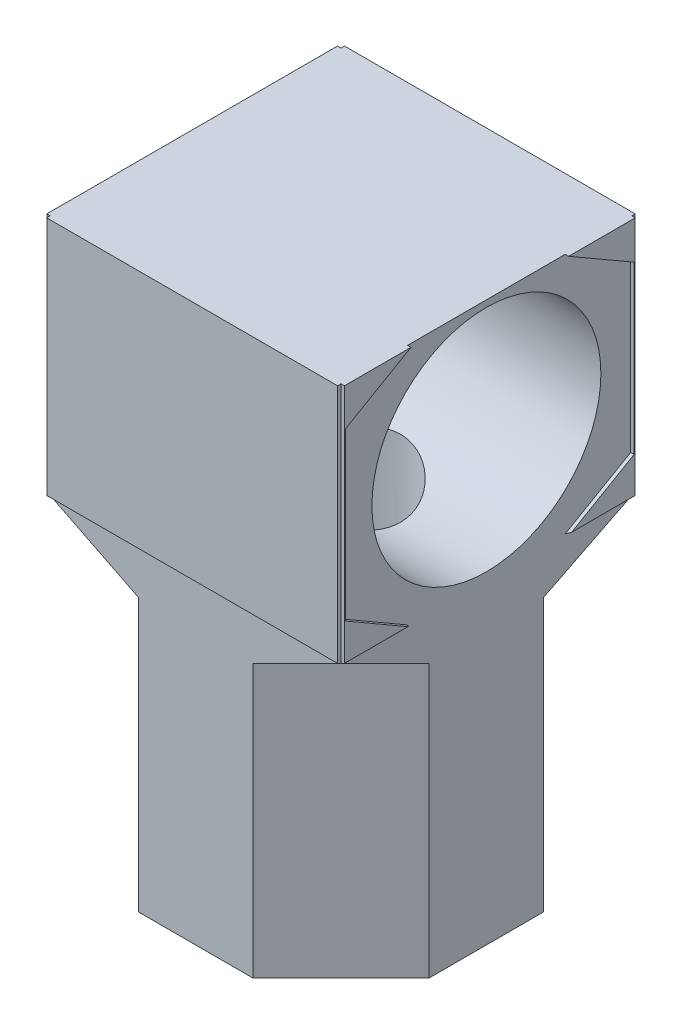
ISO-10303-21;
HEADER;
FILE_DESCRIPTION(('STEP AP214'),'2;1');
FILE_NAME('part.step','',(''),(''),'','','');
FILE_SCHEMA(('AUTOMOTIVE_DESIGN { 1 0 10303 214 1 1 1 1 }'));
ENDSEC;
DATA;
#1=APPLICATION_CONTEXT('core data for automotive mechanical design processes');
#2=APPLICATION_PROTOCOL_DEFINITION('international standard','automotive_design',2000,#1);
#3=PRODUCT_CONTEXT('',#1,'mechanical');
#4=PRODUCT('Part','Part','',(#3));
#5=PRODUCT_RELATED_PRODUCT_CATEGORY('part','',(#4));
#6=PRODUCT_DEFINITION_FORMATION('','',#4);
#7=PRODUCT_DEFINITION_CONTEXT('part definition',#1,'design');
#8=PRODUCT_DEFINITION('design','',#6,#7);
#9=PRODUCT_DEFINITION_SHAPE('','',#8);
#10=(LENGTH_UNIT() NAMED_UNIT(*) SI_UNIT(.MILLI.,.METRE.));
#11=(NAMED_UNIT(*) PLANE_ANGLE_UNIT() SI_UNIT($,.RADIAN.));
#12=(NAMED_UNIT(*) SI_UNIT($,.STERADIAN.) SOLID_ANGLE_UNIT());
#13=UNCERTAINTY_MEASURE_WITH_UNIT(LENGTH_MEASURE(1.E-05),#10,'distance_accuracy_value','');
#14=(GEOMETRIC_REPRESENTATION_CONTEXT(3) GLOBAL_UNCERTAINTY_ASSIGNED_CONTEXT((#13)) GLOBAL_UNIT_ASSIGNED_CONTEXT((#10,
#11,#12)) REPRESENTATION_CONTEXT('',''));
#15=CARTESIAN_POINT('',(0.,0.,0.));
#16=DIRECTION('',(0.,0.,1.));
#17=DIRECTION('',(1.,0.,0.));
#18=AXIS2_PLACEMENT_3D('',#15,#16,#17);
#19=CARTESIAN_POINT('',(-4.90369930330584,-0.381000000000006,-4.9036993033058));
#20=DIRECTION('',(0.,-1.,0.));
#21=DIRECTION('',(0.,0.,-1.));
#22=AXIS2_PLACEMENT_3D('',#19,#20,#21);
#23=PLANE('',#22);
#24=DIRECTION('',(1.,0.,0.));
#25=VECTOR('',#24,1.);
#26=CARTESIAN_POINT('',(-8.06450000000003,-0.381000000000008,-3.17499999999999));
#27=LINE('',#26,#25);
#28=CARTESIAN_POINT('',(-3.17500000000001,-0.381000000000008,-3.17499999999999));
#29=VERTEX_POINT('',#28);
#30=CARTESIAN_POINT('',(-8.06450000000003,-0.381000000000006,-3.17500000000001));
#31=VERTEX_POINT('',#30);
#32=EDGE_CURVE('E261',#29,#31,#27,.F.);
#33=ORIENTED_EDGE('',*,*,#32,.F.);
#34=DIRECTION('',(0.,0.,1.));
#35=VECTOR('',#34,1.);
#36=CARTESIAN_POINT('',(-3.17500000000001,-0.381000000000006,-8.06449999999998));
#37=LINE('',#36,#35);
#38=CARTESIAN_POINT('',(-3.17500000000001,-0.381000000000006,-8.06449999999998));
#39=VERTEX_POINT('',#38);
#40=EDGE_CURVE('E269',#39,#29,#37,.T.);
#41=ORIENTED_EDGE('',*,*,#40,.F.);
#42=DIRECTION('',(-0.707106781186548,0.,0.707106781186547));
#43=VECTOR('',#42,1.);
#44=CARTESIAN_POINT('',(-8.06450000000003,-0.381000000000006,-3.17500000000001));
#45=LINE('',#44,#43);
#46=EDGE_CURVE('E276',#31,#39,#45,.F.);
#47=ORIENTED_EDGE('',*,*,#46,.F.);
#48=EDGE_LOOP('',(#33,#41,#47));
#49=FACE_BOUND('',#48,.T.);
#50=ADVANCED_FACE('F17',(#49),#23,.F.);
#51=CARTESIAN_POINT('',(-3.17500000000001,-0.381000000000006,-8.06449999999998));
#52=DIRECTION('',(-0.447213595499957,-0.894427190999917,0.));
#53=DIRECTION('',(0.894427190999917,-0.447213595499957,0.));
#54=AXIS2_PLACEMENT_3D('',#51,#52,#53);
#55=PLANE('',#54);
#56=DIRECTION('',(0.,0.,-1.));
#57=VECTOR('',#56,1.);
#58=CARTESIAN_POINT('',(-3.17500000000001,-0.381000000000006,4.90369930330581));
#59=LINE('',#58,#57);
#60=CARTESIAN_POINT('',(-3.17500000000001,-0.381000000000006,3.17500000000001));
#61=VERTEX_POINT('',#60);
#62=CARTESIAN_POINT('',(-3.17500000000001,-0.381000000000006,8.06450000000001));
#63=VERTEX_POINT('',#62);
#64=EDGE_CURVE('E243',#61,#63,#59,.F.);
#65=ORIENTED_EDGE('',*,*,#64,.T.);
#66=DIRECTION('',(0.894427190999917,-0.447213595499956,0.));
#67=VECTOR('',#66,1.);
#68=CARTESIAN_POINT('',(-8.06450000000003,2.06374999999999,8.06450000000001));
#69=LINE('',#68,#67);
#70=CARTESIAN_POINT('',(-8.06450000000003,2.06374999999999,8.06450000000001));
#71=VERTEX_POINT('',#70);
#72=EDGE_CURVE('E264',#71,#63,#69,.T.);
#73=ORIENTED_EDGE('',*,*,#72,.F.);
#74=DIRECTION('',(-0.666666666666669,0.333333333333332,0.666666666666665));
#75=VECTOR('',#74,1.);
#76=CARTESIAN_POINT('',(-3.17500000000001,-0.381000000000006,3.17500000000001));
#77=LINE('',#76,#75);
#78=EDGE_CURVE('E253',#61,#71,#77,.T.);
#79=ORIENTED_EDGE('',*,*,#78,.F.);
#80=EDGE_LOOP('',(#65,#73,#79));
#81=FACE_BOUND('',#80,.T.);
#82=ADVANCED_FACE('F263',(#81),#55,.T.);
#83=CARTESIAN_POINT('',(-4.90369930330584,-0.381000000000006,4.90369930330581));
#84=DIRECTION('',(0.,-1.,0.));
#85=DIRECTION('',(0.,0.,-1.));
#86=AXIS2_PLACEMENT_3D('',#83,#84,#85);
#87=PLANE('',#86);
#88=ORIENTED_EDGE('',*,*,#64,.F.);
#89=DIRECTION('',(1.,0.,0.));
#90=VECTOR('',#89,1.);
#91=CARTESIAN_POINT('',(-8.06450000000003,-0.381000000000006,3.17500000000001));
#92=LINE('',#91,#90);
#93=CARTESIAN_POINT('',(-8.06450000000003,-0.381000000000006,3.17500000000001));
#94=VERTEX_POINT('',#93);
#95=EDGE_CURVE('E246',#94,#61,#92,.T.);
#96=ORIENTED_EDGE('',*,*,#95,.F.);
#97=DIRECTION('',(0.707106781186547,0.,0.707106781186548));
#98=VECTOR('',#97,1.);
#99=CARTESIAN_POINT('',(-3.17500000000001,-0.381000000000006,8.06450000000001));
#100=LINE('',#99,#98);
#101=EDGE_CURVE('E248',#63,#94,#100,.F.);
#102=ORIENTED_EDGE('',*,*,#101,.F.);
#103=EDGE_LOOP('',(#88,#96,#102));
#104=FACE_BOUND('',#103,.T.);
#105=ADVANCED_FACE('F245',(#104),#87,.F.);
#106=CARTESIAN_POINT('',(-8.06450000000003,-0.381000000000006,3.17500000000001));
#107=DIRECTION('',(0.,-0.894427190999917,0.447213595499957));
#108=DIRECTION('',(0.,-0.447213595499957,-0.894427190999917));
#109=AXIS2_PLACEMENT_3D('',#106,#107,#108);
#110=PLANE('',#109);
#111=DIRECTION('',(0.,-0.447213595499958,-0.894427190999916));
#112=VECTOR('',#111,1.);
#113=CARTESIAN_POINT('',(-8.06450000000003,2.06374999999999,8.06450000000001));
#114=LINE('',#113,#112);
#115=EDGE_CURVE('E260',#71,#94,#114,.T.);
#116=ORIENTED_EDGE('',*,*,#115,.T.);
#117=ORIENTED_EDGE('',*,*,#95,.T.);
#118=ORIENTED_EDGE('',*,*,#78,.T.);
#119=EDGE_LOOP('',(#116,#117,#118));
#120=FACE_BOUND('',#119,.T.);
#121=ADVANCED_FACE('F257',(#120),#110,.T.);
#122=CARTESIAN_POINT('',(-8.06450000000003,2.15899999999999,-8.25499999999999));
#123=DIRECTION('',(0.,-0.894427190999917,-0.447213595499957));
#124=DIRECTION('',(0.,0.447213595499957,-0.894427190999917));
#125=AXIS2_PLACEMENT_3D('',#122,#123,#124);
#126=PLANE('',#125);
#127=ORIENTED_EDGE('',*,*,#32,.T.);
#128=DIRECTION('',(0.,0.447213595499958,-0.894427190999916));
#129=VECTOR('',#128,1.);
#130=CARTESIAN_POINT('',(-8.06450000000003,-0.381000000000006,-3.17500000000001));
#131=LINE('',#130,#129);
#132=CARTESIAN_POINT('',(-8.06450000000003,2.06374999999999,-8.06449999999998));
#133=VERTEX_POINT('',#132);
#134=EDGE_CURVE('E286',#31,#133,#131,.T.);
#135=ORIENTED_EDGE('',*,*,#134,.T.);
#136=DIRECTION('',(-0.666666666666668,0.333333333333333,-0.666666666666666));
#137=VECTOR('',#136,1.);
#138=CARTESIAN_POINT('',(-3.17500000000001,-0.381000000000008,-3.17499999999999));
#139=LINE('',#138,#137);
#140=EDGE_CURVE('E268',#29,#133,#139,.T.);
#141=ORIENTED_EDGE('',*,*,#140,.F.);
#142=EDGE_LOOP('',(#127,#135,#141));
#143=FACE_BOUND('',#142,.T.);
#144=ADVANCED_FACE('F969',(#143),#126,.T.);
#145=CARTESIAN_POINT('',(-3.17500000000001,-0.381000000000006,-8.06449999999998));
#146=DIRECTION('',(-0.447213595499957,-0.894427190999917,0.));
#147=DIRECTION('',(0.894427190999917,-0.447213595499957,0.));
#148=AXIS2_PLACEMENT_3D('',#145,#146,#147);
#149=PLANE('',#148);
#150=DIRECTION('',(0.894427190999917,-0.447213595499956,0.));
#151=VECTOR('',#150,1.);
#152=CARTESIAN_POINT('',(-8.06450000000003,2.06374999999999,-8.06449999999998));
#153=LINE('',#152,#151);
#154=EDGE_CURVE('E289',#133,#39,#153,.T.);
#155=ORIENTED_EDGE('',*,*,#154,.T.);
#156=ORIENTED_EDGE('',*,*,#40,.T.);
#157=ORIENTED_EDGE('',*,*,#140,.T.);
#158=EDGE_LOOP('',(#155,#156,#157));
#159=FACE_BOUND('',#158,.T.);
#160=ADVANCED_FACE('F958',(#159),#149,.T.);
#161=CARTESIAN_POINT('',(-8.06450000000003,2.15899999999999,-8.25499999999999));
#162=DIRECTION('',(0.,-0.894427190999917,-0.447213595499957));
#163=DIRECTION('',(0.,0.447213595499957,-0.894427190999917));
#164=AXIS2_PLACEMENT_3D('',#161,#162,#163);
#165=PLANE('',#164);
#166=DIRECTION('',(-1.,0.,0.));
#167=VECTOR('',#166,1.);
#168=CARTESIAN_POINT('',(-8.06450000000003,2.15899999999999,-8.25499999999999));
#169=LINE('',#168,#167);
#170=CARTESIAN_POINT('',(8.06449999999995,2.15899999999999,-8.25499999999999));
#171=VERTEX_POINT('',#170);
#172=CARTESIAN_POINT('',(-8.06450000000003,2.15899999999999,-8.25499999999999));
#173=VERTEX_POINT('',#172);
#174=EDGE_CURVE('E320',#171,#173,#169,.T.);
#175=ORIENTED_EDGE('',*,*,#174,.F.);
#176=DIRECTION('',(0.,0.447213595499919,-0.894427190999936));
#177=VECTOR('',#176,1.);
#178=CARTESIAN_POINT('',(8.06449999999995,2.06374999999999,-8.06449999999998));
#179=LINE('',#178,#177);
#180=CARTESIAN_POINT('',(8.06449999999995,2.06374999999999,-8.06449999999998));
#181=VERTEX_POINT('',#180);
#182=EDGE_CURVE('E315',#181,#171,#179,.T.);
#183=ORIENTED_EDGE('',*,*,#182,.F.);
#184=DIRECTION('',(1.,0.,0.));
#185=VECTOR('',#184,1.);
#186=CARTESIAN_POINT('',(0.,2.06374999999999,-8.06449999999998));
#187=LINE('',#186,#185);
#188=EDGE_CURVE('E297',#181,#133,#187,.F.);
#189=ORIENTED_EDGE('',*,*,#188,.T.);
#190=DIRECTION('',(0.,0.447213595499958,-0.894427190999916));
#191=VECTOR('',#190,1.);
#192=CARTESIAN_POINT('',(-8.06450000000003,2.06374999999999,-8.0645));
#193=LINE('',#192,#191);
#194=EDGE_CURVE('E322',#133,#173,#193,.T.);
#195=ORIENTED_EDGE('',*,*,#194,.T.);
#196=EDGE_LOOP('',(#175,#183,#189,#195));
#197=FACE_BOUND('',#196,.T.);
#198=ADVANCED_FACE('F947',(#197),#165,.T.);
#199=CARTESIAN_POINT('',(-8.06450000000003,-0.381000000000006,3.17500000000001));
#200=DIRECTION('',(0.,-0.894427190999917,0.447213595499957));
#201=DIRECTION('',(0.,-0.447213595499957,-0.894427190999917));
#202=AXIS2_PLACEMENT_3D('',#199,#200,#201);
#203=PLANE('',#202);
#204=DIRECTION('',(1.,0.,0.));
#205=VECTOR('',#204,1.);
#206=CARTESIAN_POINT('',(-8.06450000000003,2.15899999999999,8.25499999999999));
#207=LINE('',#206,#205);
#208=CARTESIAN_POINT('',(-8.06450000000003,2.15899999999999,8.25499999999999));
#209=VERTEX_POINT('',#208);
#210=CARTESIAN_POINT('',(8.06449999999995,2.15899999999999,8.25499999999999));
#211=VERTEX_POINT('',#210);
#212=EDGE_CURVE('E334',#209,#211,#207,.T.);
#213=ORIENTED_EDGE('',*,*,#212,.F.);
#214=DIRECTION('',(0.,-0.447213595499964,-0.894427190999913));
#215=VECTOR('',#214,1.);
#216=CARTESIAN_POINT('',(-8.06450000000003,2.15899999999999,8.25499999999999));
#217=LINE('',#216,#215);
#218=EDGE_CURVE('E328',#209,#71,#217,.T.);
#219=ORIENTED_EDGE('',*,*,#218,.T.);
#220=DIRECTION('',(1.,0.,0.));
#221=VECTOR('',#220,1.);
#222=CARTESIAN_POINT('',(0.,2.06374999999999,8.06450000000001));
#223=LINE('',#222,#221);
#224=CARTESIAN_POINT('',(8.06449999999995,2.06374999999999,8.06450000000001));
#225=VERTEX_POINT('',#224);
#226=EDGE_CURVE('E278',#225,#71,#223,.F.);
#227=ORIENTED_EDGE('',*,*,#226,.F.);
#228=DIRECTION('',(0.,-0.447213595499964,-0.894427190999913));
#229=VECTOR('',#228,1.);
#230=CARTESIAN_POINT('',(8.06449999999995,2.15899999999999,8.25499999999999));
#231=LINE('',#230,#229);
#232=EDGE_CURVE('E339',#211,#225,#231,.T.);
#233=ORIENTED_EDGE('',*,*,#232,.F.);
#234=EDGE_LOOP('',(#213,#219,#227,#233));
#235=FACE_BOUND('',#234,.T.);
#236=ADVANCED_FACE('F936',(#235),#203,.T.);
#237=CARTESIAN_POINT('',(8.25499999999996,2.15899999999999,-8.06449999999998));
#238=DIRECTION('',(0.447213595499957,-0.894427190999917,0.));
#239=DIRECTION('',(0.894427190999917,0.447213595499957,0.));
#240=AXIS2_PLACEMENT_3D('',#237,#238,#239);
#241=PLANE('',#240);
#242=DIRECTION('',(0.894427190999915,0.44721359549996,0.));
#243=VECTOR('',#242,1.);
#244=CARTESIAN_POINT('',(3.17499999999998,-0.381000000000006,8.06450000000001));
#245=LINE('',#244,#243);
#246=CARTESIAN_POINT('',(3.17499999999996,-0.381000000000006,8.06449999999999));
#247=VERTEX_POINT('',#246);
#248=EDGE_CURVE('E279',#247,#225,#245,.T.);
#249=ORIENTED_EDGE('',*,*,#248,.F.);
#250=DIRECTION('',(0.,0.,-1.));
#251=VECTOR('',#250,1.);
#252=CARTESIAN_POINT('',(3.17499999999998,-0.381000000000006,4.90369930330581));
#253=LINE('',#252,#251);
#254=CARTESIAN_POINT('',(3.17499999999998,-0.381000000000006,3.17500000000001));
#255=VERTEX_POINT('',#254);
#256=EDGE_CURVE('E272',#247,#255,#253,.T.);
#257=ORIENTED_EDGE('',*,*,#256,.T.);
#258=DIRECTION('',(-0.666666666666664,-0.333333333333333,-0.666666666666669));
#259=VECTOR('',#258,1.);
#260=CARTESIAN_POINT('',(8.06449999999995,2.06374999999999,8.06450000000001));
#261=LINE('',#260,#259);
#262=EDGE_CURVE('E364',#225,#255,#261,.T.);
#263=ORIENTED_EDGE('',*,*,#262,.F.);
#264=EDGE_LOOP('',(#249,#257,#263));
#265=FACE_BOUND('',#264,.T.);
#266=ADVANCED_FACE('F925',(#265),#241,.T.);
#267=CARTESIAN_POINT('',(4.90369930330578,-0.381000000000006,4.90369930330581));
#268=DIRECTION('',(0.,-1.,0.));
#269=DIRECTION('',(0.,0.,-1.));
#270=AXIS2_PLACEMENT_3D('',#267,#268,#269);
#271=PLANE('',#270);
#272=DIRECTION('',(1.,0.,0.));
#273=VECTOR('',#272,1.);
#274=CARTESIAN_POINT('',(-8.06450000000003,-0.381000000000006,3.17500000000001));
#275=LINE('',#274,#273);
#276=CARTESIAN_POINT('',(8.06449999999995,-0.381000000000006,3.17500000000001));
#277=VERTEX_POINT('',#276);
#278=EDGE_CURVE('E73',#255,#277,#275,.T.);
#279=ORIENTED_EDGE('',*,*,#278,.F.);
#280=ORIENTED_EDGE('',*,*,#256,.F.);
#281=DIRECTION('',(0.707106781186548,0.,-0.707106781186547));
#282=VECTOR('',#281,1.);
#283=CARTESIAN_POINT('',(8.06449999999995,-0.381000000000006,3.17500000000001));
#284=LINE('',#283,#282);
#285=EDGE_CURVE('E368',#277,#247,#284,.F.);
#286=ORIENTED_EDGE('',*,*,#285,.F.);
#287=EDGE_LOOP('',(#279,#280,#286));
#288=FACE_BOUND('',#287,.T.);
#289=ADVANCED_FACE('F914',(#288),#271,.F.);
#290=CARTESIAN_POINT('',(-8.06450000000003,-15.494,-3.17500000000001));
#291=DIRECTION('',(-0.707106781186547,0.,-0.707106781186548));
#292=DIRECTION('',(-0.707106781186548,0.,0.707106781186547));
#293=AXIS2_PLACEMENT_3D('',#290,#291,#292);
#294=PLANE('',#293);
#295=DIRECTION('',(0.70710678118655,0.,-0.707106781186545));
#296=VECTOR('',#295,1.);
#297=CARTESIAN_POINT('',(-8.06450000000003,-15.494,-3.17500000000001));
#298=LINE('',#297,#296);
#299=CARTESIAN_POINT('',(-8.06450000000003,-15.494,-3.17500000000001));
#300=VERTEX_POINT('',#299);
#301=CARTESIAN_POINT('',(-3.17500000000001,-15.494,-8.06450000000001));
#302=VERTEX_POINT('',#301);
#303=EDGE_CURVE('E372',#300,#302,#298,.T.);
#304=ORIENTED_EDGE('',*,*,#303,.F.);
#305=DIRECTION('',(0.,1.,0.));
#306=VECTOR('',#305,1.);
#307=CARTESIAN_POINT('',(-8.06450000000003,1.78895756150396,-3.17500000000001));
#308=LINE('',#307,#306);
#309=EDGE_CURVE('E290',#300,#31,#308,.T.);
#310=ORIENTED_EDGE('',*,*,#309,.T.);
#311=ORIENTED_EDGE('',*,*,#46,.T.);
#312=DIRECTION('',(0.,1.,0.));
#313=VECTOR('',#312,1.);
#314=CARTESIAN_POINT('',(-3.17500000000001,1.78895756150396,-8.06449999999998));
#315=LINE('',#314,#313);
#316=EDGE_CURVE('E301',#39,#302,#315,.F.);
#317=ORIENTED_EDGE('',*,*,#316,.T.);
#318=EDGE_LOOP('',(#304,#310,#311,#317));
#319=FACE_BOUND('',#318,.T.);
#320=ADVANCED_FACE('F903',(#319),#294,.T.);
#321=CARTESIAN_POINT('',(0.,1.78895756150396,8.06450000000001));
#322=DIRECTION('',(0.,0.,1.));
#323=DIRECTION('',(1.,0.,0.));
#324=AXIS2_PLACEMENT_3D('',#321,#322,#323);
#325=PLANE('',#324);
#326=DIRECTION('',(0.,1.,0.));
#327=VECTOR('',#326,1.);
#328=CARTESIAN_POINT('',(3.17499999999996,-15.494,8.06449999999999));
#329=LINE('',#328,#327);
#330=CARTESIAN_POINT('',(3.17499999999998,-15.494,8.06450000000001));
#331=VERTEX_POINT('',#330);
#332=EDGE_CURVE('E370',#247,#331,#329,.F.);
#333=ORIENTED_EDGE('',*,*,#332,.F.);
#334=ORIENTED_EDGE('',*,*,#248,.T.);
#335=ORIENTED_EDGE('',*,*,#226,.T.);
#336=ORIENTED_EDGE('',*,*,#72,.T.);
#337=DIRECTION('',(0.,1.,0.));
#338=VECTOR('',#337,1.);
#339=CARTESIAN_POINT('',(-3.17500000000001,-15.494,8.06450000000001));
#340=LINE('',#339,#338);
#341=CARTESIAN_POINT('',(-3.17500000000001,-15.494,8.06450000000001));
#342=VERTEX_POINT('',#341);
#343=EDGE_CURVE('E283',#342,#63,#340,.T.);
#344=ORIENTED_EDGE('',*,*,#343,.F.);
#345=DIRECTION('',(1.,0.,0.));
#346=VECTOR('',#345,1.);
#347=CARTESIAN_POINT('',(4.90369930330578,-15.494,8.06450000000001));
#348=LINE('',#347,#346);
#349=EDGE_CURVE('E381',#331,#342,#348,.F.);
#350=ORIENTED_EDGE('',*,*,#349,.F.);
#351=EDGE_LOOP('',(#333,#334,#335,#336,#344,#350));
#352=FACE_BOUND('',#351,.T.);
#353=ADVANCED_FACE('F892',(#352),#325,.T.);
#354=CARTESIAN_POINT('',(-3.17500000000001,-15.494,8.06450000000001));
#355=DIRECTION('',(-0.707106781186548,0.,0.707106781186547));
#356=DIRECTION('',(0.707106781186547,0.,0.707106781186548));
#357=AXIS2_PLACEMENT_3D('',#354,#355,#356);
#358=PLANE('',#357);
#359=DIRECTION('',(-0.70710678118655,0.,-0.707106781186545));
#360=VECTOR('',#359,1.);
#361=CARTESIAN_POINT('',(-3.17500000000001,-15.494,8.06450000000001));
#362=LINE('',#361,#360);
#363=CARTESIAN_POINT('',(-8.06450000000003,-15.494,3.17500000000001));
#364=VERTEX_POINT('',#363);
#365=EDGE_CURVE('E379',#342,#364,#362,.T.);
#366=ORIENTED_EDGE('',*,*,#365,.F.);
#367=ORIENTED_EDGE('',*,*,#343,.T.);
#368=ORIENTED_EDGE('',*,*,#101,.T.);
#369=DIRECTION('',(0.,1.,0.));
#370=VECTOR('',#369,1.);
#371=CARTESIAN_POINT('',(-8.06450000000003,1.78895756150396,3.17500000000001));
#372=LINE('',#371,#370);
#373=EDGE_CURVE('E293',#94,#364,#372,.F.);
#374=ORIENTED_EDGE('',*,*,#373,.T.);
#375=EDGE_LOOP('',(#366,#367,#368,#374));
#376=FACE_BOUND('',#375,.T.);
#377=ADVANCED_FACE('F881',(#376),#358,.T.);
#378=CARTESIAN_POINT('',(-8.06450000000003,1.78895756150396,0.));
#379=DIRECTION('',(1.,0.,0.));
#380=DIRECTION('',(0.,0.,-1.));
#381=AXIS2_PLACEMENT_3D('',#378,#379,#380);
#382=PLANE('',#381);
#383=ORIENTED_EDGE('',*,*,#134,.F.);
#384=ORIENTED_EDGE('',*,*,#309,.F.);
#385=DIRECTION('',(0.,0.,-1.));
#386=VECTOR('',#385,1.);
#387=CARTESIAN_POINT('',(-8.06450000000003,-15.494,-4.9036993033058));
#388=LINE('',#387,#386);
#389=EDGE_CURVE('E375',#364,#300,#388,.T.);
#390=ORIENTED_EDGE('',*,*,#389,.F.);
#391=ORIENTED_EDGE('',*,*,#373,.F.);
#392=ORIENTED_EDGE('',*,*,#115,.F.);
#393=DIRECTION('',(0.,0.,1.));
#394=VECTOR('',#393,1.);
#395=CARTESIAN_POINT('',(-8.06450000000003,2.06375,-8.06449999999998));
#396=LINE('',#395,#394);
#397=EDGE_CURVE('E354',#133,#71,#396,.T.);
#398=ORIENTED_EDGE('',*,*,#397,.F.);
#399=EDGE_LOOP('',(#383,#384,#390,#391,#392,#398));
#400=FACE_BOUND('',#399,.T.);
#401=ADVANCED_FACE('F870',(#400),#382,.F.);
#402=CARTESIAN_POINT('',(0.,1.78895756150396,-8.06449999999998));
#403=DIRECTION('',(0.,0.,1.));
#404=DIRECTION('',(1.,0.,0.));
#405=AXIS2_PLACEMENT_3D('',#402,#403,#404);
#406=PLANE('',#405);
#407=DIRECTION('',(0.894427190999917,0.447213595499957,0.));
#408=VECTOR('',#407,1.);
#409=CARTESIAN_POINT('',(8.25499999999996,2.15899999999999,-8.0645));
#410=LINE('',#409,#408);
#411=CARTESIAN_POINT('',(3.17499999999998,-0.381000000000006,-8.0645));
#412=VERTEX_POINT('',#411);
#413=EDGE_CURVE('E300',#412,#181,#410,.T.);
#414=ORIENTED_EDGE('',*,*,#413,.F.);
#415=DIRECTION('',(0.,1.,0.));
#416=VECTOR('',#415,1.);
#417=CARTESIAN_POINT('',(3.17499999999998,-15.494,-8.0645));
#418=LINE('',#417,#416);
#419=CARTESIAN_POINT('',(3.17499999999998,-15.494,-8.0645));
#420=VERTEX_POINT('',#419);
#421=EDGE_CURVE('E389',#420,#412,#418,.T.);
#422=ORIENTED_EDGE('',*,*,#421,.F.);
#423=DIRECTION('',(1.,0.,0.));
#424=VECTOR('',#423,1.);
#425=CARTESIAN_POINT('',(4.90369930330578,-15.494,-8.0645));
#426=LINE('',#425,#424);
#427=EDGE_CURVE('E386',#302,#420,#426,.T.);
#428=ORIENTED_EDGE('',*,*,#427,.F.);
#429=ORIENTED_EDGE('',*,*,#316,.F.);
#430=ORIENTED_EDGE('',*,*,#154,.F.);
#431=ORIENTED_EDGE('',*,*,#188,.F.);
#432=EDGE_LOOP('',(#414,#422,#428,#429,#430,#431));
#433=FACE_BOUND('',#432,.T.);
#434=ADVANCED_FACE('F859',(#433),#406,.F.);
#435=CARTESIAN_POINT('',(8.25499999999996,2.15899999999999,-8.06449999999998));
#436=DIRECTION('',(0.447213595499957,-0.894427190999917,0.));
#437=DIRECTION('',(0.894427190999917,0.447213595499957,0.));
#438=AXIS2_PLACEMENT_3D('',#435,#436,#437);
#439=PLANE('',#438);
#440=DIRECTION('',(0.,0.,-1.));
#441=VECTOR('',#440,1.);
#442=CARTESIAN_POINT('',(3.17499999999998,-0.381000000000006,-4.9036993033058));
#443=LINE('',#442,#441);
#444=CARTESIAN_POINT('',(3.17499999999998,-0.381000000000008,-3.17499999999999));
#445=VERTEX_POINT('',#444);
#446=EDGE_CURVE('E308',#445,#412,#443,.T.);
#447=ORIENTED_EDGE('',*,*,#446,.T.);
#448=ORIENTED_EDGE('',*,*,#413,.T.);
#449=DIRECTION('',(0.666666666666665,0.333333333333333,-0.666666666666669));
#450=VECTOR('',#449,1.);
#451=CARTESIAN_POINT('',(3.17499999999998,-0.381000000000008,-3.17499999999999));
#452=LINE('',#451,#450);
#453=EDGE_CURVE('E392',#445,#181,#452,.T.);
#454=ORIENTED_EDGE('',*,*,#453,.F.);
#455=EDGE_LOOP('',(#447,#448,#454));
#456=FACE_BOUND('',#455,.T.);
#457=ADVANCED_FACE('F848',(#456),#439,.T.);
#458=CARTESIAN_POINT('',(4.90369930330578,-0.381000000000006,-4.9036993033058));
#459=DIRECTION('',(0.,-1.,0.));
#460=DIRECTION('',(0.,0.,-1.));
#461=AXIS2_PLACEMENT_3D('',#458,#459,#460);
#462=PLANE('',#461);
#463=ORIENTED_EDGE('',*,*,#446,.F.);
#464=DIRECTION('',(1.,0.,0.));
#465=VECTOR('',#464,1.);
#466=CARTESIAN_POINT('',(-8.06450000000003,-0.381000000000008,-3.17499999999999));
#467=LINE('',#466,#465);
#468=CARTESIAN_POINT('',(8.06449999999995,-0.381000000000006,-3.17499999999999));
#469=VERTEX_POINT('',#468);
#470=EDGE_CURVE('E397',#469,#445,#467,.F.);
#471=ORIENTED_EDGE('',*,*,#470,.F.);
#472=DIRECTION('',(-0.707106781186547,0.,-0.707106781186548));
#473=VECTOR('',#472,1.);
#474=CARTESIAN_POINT('',(3.17499999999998,-0.381000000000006,-8.0645));
#475=LINE('',#474,#473);
#476=EDGE_CURVE('E378',#412,#469,#475,.F.);
#477=ORIENTED_EDGE('',*,*,#476,.F.);
#478=EDGE_LOOP('',(#463,#471,#477));
#479=FACE_BOUND('',#478,.T.);
#480=ADVANCED_FACE('F837',(#479),#462,.F.);
#481=CARTESIAN_POINT('',(8.25499999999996,14.351,-8.06449999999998));
#482=DIRECTION('',(1.,0.,0.));
#483=DIRECTION('',(0.,0.,-1.));
#484=AXIS2_PLACEMENT_3D('',#481,#482,#483);
#485=PLANE('',#484);
#486=DIRECTION('',(0.,0.499999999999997,0.86602540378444));
#487=VECTOR('',#486,1.);
#488=CARTESIAN_POINT('',(8.25499999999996,13.3982545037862,-8.00099999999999));
#489=LINE('',#488,#487);
#490=CARTESIAN_POINT('',(8.25499999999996,15.494,-4.37106232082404));
#491=VERTEX_POINT('',#490);
#492=CARTESIAN_POINT('',(8.25499999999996,13.3982545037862,-8.00099999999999));
#493=VERTEX_POINT('',#492);
#494=EDGE_CURVE('E420',#491,#493,#489,.F.);
#495=ORIENTED_EDGE('',*,*,#494,.T.);
#496=DIRECTION('',(0.,1.,0.));
#497=VECTOR('',#496,1.);
#498=CARTESIAN_POINT('',(8.25499999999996,4.15949549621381,-8.00099999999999));
#499=LINE('',#498,#497);
#500=CARTESIAN_POINT('',(8.25499999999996,4.15949549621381,-8.00099999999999));
#501=VERTEX_POINT('',#500);
#502=EDGE_CURVE('E414',#493,#501,#499,.F.);
#503=ORIENTED_EDGE('',*,*,#502,.T.);
#504=DIRECTION('',(0.,0.499999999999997,-0.86602540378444));
#505=VECTOR('',#504,1.);
#506=CARTESIAN_POINT('',(8.25499999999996,-0.459884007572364,0.));
#507=LINE('',#506,#505);
#508=CARTESIAN_POINT('',(8.25499999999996,2.15899999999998,-4.53604016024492));
#509=VERTEX_POINT('',#508);
#510=EDGE_CURVE('E405',#501,#509,#507,.F.);
#511=ORIENTED_EDGE('',*,*,#510,.T.);
#512=DIRECTION('',(0.,0.,1.));
#513=VECTOR('',#512,1.);
#514=CARTESIAN_POINT('',(8.25499999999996,2.15899999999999,-8.06449999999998));
#515=LINE('',#514,#513);
#516=CARTESIAN_POINT('',(8.25499999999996,2.15899999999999,-8.06449999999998));
#517=VERTEX_POINT('',#516);
#518=EDGE_CURVE('E403',#517,#509,#515,.T.);
#519=ORIENTED_EDGE('',*,*,#518,.F.);
#520=DIRECTION('',(0.,1.,0.));
#521=VECTOR('',#520,1.);
#522=CARTESIAN_POINT('',(8.25499999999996,1.78895756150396,-8.06449999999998));
#523=LINE('',#522,#521);
#524=CARTESIAN_POINT('',(8.25499999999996,15.494,-8.06449999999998));
#525=VERTEX_POINT('',#524);
#526=EDGE_CURVE('E311',#517,#525,#523,.T.);
#527=ORIENTED_EDGE('',*,*,#526,.T.);
#528=DIRECTION('',(0.,0.,1.));
#529=VECTOR('',#528,1.);
#530=CARTESIAN_POINT('',(8.25499999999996,15.494,-8.06449999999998));
#531=LINE('',#530,#529);
#532=EDGE_CURVE('E450',#491,#525,#531,.F.);
#533=ORIENTED_EDGE('',*,*,#532,.F.);
#534=EDGE_LOOP('',(#495,#503,#511,#519,#527,#533));
#535=FACE_BOUND('',#534,.T.);
#536=ADVANCED_FACE('F826',(#535),#485,.T.);
#537=CARTESIAN_POINT('',(0.,1.78895756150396,-8.06449999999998));
#538=DIRECTION('',(0.,0.,1.));
#539=DIRECTION('',(1.,0.,0.));
#540=AXIS2_PLACEMENT_3D('',#537,#538,#539);
#541=PLANE('',#540);
#542=DIRECTION('',(1.,0.,0.));
#543=VECTOR('',#542,1.);
#544=CARTESIAN_POINT('',(-8.25499999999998,15.494,-8.06449999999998));
#545=LINE('',#544,#543);
#546=CARTESIAN_POINT('',(8.06449999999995,15.494,-8.06449999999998));
#547=VERTEX_POINT('',#546);
#548=EDGE_CURVE('E448',#525,#547,#545,.F.);
#549=ORIENTED_EDGE('',*,*,#548,.F.);
#550=ORIENTED_EDGE('',*,*,#526,.F.);
#551=DIRECTION('',(0.894427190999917,0.447213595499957,0.));
#552=VECTOR('',#551,1.);
#553=CARTESIAN_POINT('',(8.25499999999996,2.15899999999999,-8.06449999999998));
#554=LINE('',#553,#552);
#555=EDGE_CURVE('E400',#181,#517,#554,.T.);
#556=ORIENTED_EDGE('',*,*,#555,.F.);
#557=DIRECTION('',(0.,1.,0.));
#558=VECTOR('',#557,1.);
#559=CARTESIAN_POINT('',(8.06449999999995,1.78895756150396,-8.06449999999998));
#560=LINE('',#559,#558);
#561=EDGE_CURVE('E314',#547,#181,#560,.F.);
#562=ORIENTED_EDGE('',*,*,#561,.F.);
#563=EDGE_LOOP('',(#549,#550,#556,#562));
#564=FACE_BOUND('',#563,.T.);
#565=ADVANCED_FACE('F815',(#564),#541,.F.);
#566=CARTESIAN_POINT('',(8.06449999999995,1.78895756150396,0.));
#567=DIRECTION('',(1.,0.,0.));
#568=DIRECTION('',(0.,0.,-1.));
#569=AXIS2_PLACEMENT_3D('',#566,#567,#568);
#570=PLANE('',#569);
#571=DIRECTION('',(0.,1.,0.));
#572=VECTOR('',#571,1.);
#573=CARTESIAN_POINT('',(8.06449999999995,14.351,-8.25499999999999));
#574=LINE('',#573,#572);
#575=CARTESIAN_POINT('',(8.06449999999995,15.494,-8.25499999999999));
#576=VERTEX_POINT('',#575);
#577=EDGE_CURVE('E317',#576,#171,#574,.F.);
#578=ORIENTED_EDGE('',*,*,#577,.F.);
#579=DIRECTION('',(0.,0.,1.));
#580=VECTOR('',#579,1.);
#581=CARTESIAN_POINT('',(8.06449999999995,15.494,-8.06449999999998));
#582=LINE('',#581,#580);
#583=EDGE_CURVE('E446',#547,#576,#582,.F.);
#584=ORIENTED_EDGE('',*,*,#583,.F.);
#585=ORIENTED_EDGE('',*,*,#561,.T.);
#586=ORIENTED_EDGE('',*,*,#182,.T.);
#587=EDGE_LOOP('',(#578,#584,#585,#586));
#588=FACE_BOUND('',#587,.T.);
#589=ADVANCED_FACE('F804',(#588),#570,.T.);
#590=CARTESIAN_POINT('',(-8.06450000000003,14.351,-8.25499999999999));
#591=DIRECTION('',(0.,0.,-1.));
#592=DIRECTION('',(-1.,0.,0.));
#593=AXIS2_PLACEMENT_3D('',#590,#591,#592);
#594=PLANE('',#593);
#595=DIRECTION('',(0.,1.,0.));
#596=VECTOR('',#595,1.);
#597=CARTESIAN_POINT('',(-8.06450000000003,1.78895756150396,-8.25499999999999));
#598=LINE('',#597,#596);
#599=CARTESIAN_POINT('',(-8.06450000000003,15.494,-8.25499999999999));
#600=VERTEX_POINT('',#599);
#601=EDGE_CURVE('E325',#173,#600,#598,.T.);
#602=ORIENTED_EDGE('',*,*,#601,.T.);
#603=DIRECTION('',(1.,0.,0.));
#604=VECTOR('',#603,1.);
#605=CARTESIAN_POINT('',(-8.25499999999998,15.494,-8.25499999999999));
#606=LINE('',#605,#604);
#607=EDGE_CURVE('E444',#576,#600,#606,.F.);
#608=ORIENTED_EDGE('',*,*,#607,.F.);
#609=ORIENTED_EDGE('',*,*,#577,.T.);
#610=ORIENTED_EDGE('',*,*,#174,.T.);
#611=EDGE_LOOP('',(#602,#608,#609,#610));
#612=FACE_BOUND('',#611,.T.);
#613=ADVANCED_FACE('F793',(#612),#594,.T.);
#614=CARTESIAN_POINT('',(-8.06450000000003,1.78895756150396,0.));
#615=DIRECTION('',(1.,0.,0.));
#616=DIRECTION('',(0.,0.,-1.));
#617=AXIS2_PLACEMENT_3D('',#614,#615,#616);
#618=PLANE('',#617);
#619=DIRECTION('',(0.,0.,1.));
#620=VECTOR('',#619,1.);
#621=CARTESIAN_POINT('',(-8.06450000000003,15.494,-8.06449999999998));
#622=LINE('',#621,#620);
#623=CARTESIAN_POINT('',(-8.06450000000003,15.494,-8.0645));
#624=VERTEX_POINT('',#623);
#625=EDGE_CURVE('E442',#600,#624,#622,.T.);
#626=ORIENTED_EDGE('',*,*,#625,.F.);
#627=ORIENTED_EDGE('',*,*,#601,.F.);
#628=ORIENTED_EDGE('',*,*,#194,.F.);
#629=DIRECTION('',(0.,1.,0.));
#630=VECTOR('',#629,1.);
#631=CARTESIAN_POINT('',(-8.06450000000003,1.78895756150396,-8.06449999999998));
#632=LINE('',#631,#630);
#633=EDGE_CURVE('E351',#133,#624,#632,.T.);
#634=ORIENTED_EDGE('',*,*,#633,.T.);
#635=EDGE_LOOP('',(#626,#627,#628,#634));
#636=FACE_BOUND('',#635,.T.);
#637=ADVANCED_FACE('F782',(#636),#618,.F.);
#638=CARTESIAN_POINT('',(-8.06450000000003,1.78895756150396,0.));
#639=DIRECTION('',(1.,0.,0.));
#640=DIRECTION('',(0.,0.,-1.));
#641=AXIS2_PLACEMENT_3D('',#638,#639,#640);
#642=PLANE('',#641);
#643=ORIENTED_EDGE('',*,*,#218,.F.);
#644=DIRECTION('',(0.,1.,0.));
#645=VECTOR('',#644,1.);
#646=CARTESIAN_POINT('',(-8.06450000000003,14.351,8.25499999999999));
#647=LINE('',#646,#645);
#648=CARTESIAN_POINT('',(-8.06450000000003,15.494,8.25499999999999));
#649=VERTEX_POINT('',#648);
#650=EDGE_CURVE('E333',#649,#209,#647,.F.);
#651=ORIENTED_EDGE('',*,*,#650,.F.);
#652=DIRECTION('',(0.,0.,1.));
#653=VECTOR('',#652,1.);
#654=CARTESIAN_POINT('',(-8.06450000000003,15.494,-8.06449999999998));
#655=LINE('',#654,#653);
#656=CARTESIAN_POINT('',(-8.06450000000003,15.494,8.06450000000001));
#657=VERTEX_POINT('',#656);
#658=EDGE_CURVE('E435',#657,#649,#655,.T.);
#659=ORIENTED_EDGE('',*,*,#658,.F.);
#660=DIRECTION('',(0.,1.,0.));
#661=VECTOR('',#660,1.);
#662=CARTESIAN_POINT('',(-8.06450000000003,1.78895756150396,8.06450000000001));
#663=LINE('',#662,#661);
#664=EDGE_CURVE('E349',#71,#657,#663,.T.);
#665=ORIENTED_EDGE('',*,*,#664,.F.);
#666=EDGE_LOOP('',(#643,#651,#659,#665));
#667=FACE_BOUND('',#666,.T.);
#668=ADVANCED_FACE('F771',(#667),#642,.F.);
#669=CARTESIAN_POINT('',(-8.06450000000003,14.351,8.25499999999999));
#670=DIRECTION('',(0.,0.,1.));
#671=DIRECTION('',(1.,0.,0.));
#672=AXIS2_PLACEMENT_3D('',#669,#670,#671);
#673=PLANE('',#672);
#674=ORIENTED_EDGE('',*,*,#650,.T.);
#675=ORIENTED_EDGE('',*,*,#212,.T.);
#676=DIRECTION('',(0.,1.,0.));
#677=VECTOR('',#676,1.);
#678=CARTESIAN_POINT('',(8.06449999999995,1.78895756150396,8.25499999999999));
#679=LINE('',#678,#677);
#680=CARTESIAN_POINT('',(8.06449999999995,15.494,8.25499999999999));
#681=VERTEX_POINT('',#680);
#682=EDGE_CURVE('E336',#681,#211,#679,.F.);
#683=ORIENTED_EDGE('',*,*,#682,.F.);
#684=DIRECTION('',(1.,0.,0.));
#685=VECTOR('',#684,1.);
#686=CARTESIAN_POINT('',(-8.25499999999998,15.494,8.25499999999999));
#687=LINE('',#686,#685);
#688=EDGE_CURVE('E433',#649,#681,#687,.T.);
#689=ORIENTED_EDGE('',*,*,#688,.F.);
#690=EDGE_LOOP('',(#674,#675,#683,#689));
#691=FACE_BOUND('',#690,.T.);
#692=ADVANCED_FACE('F760',(#691),#673,.T.);
#693=CARTESIAN_POINT('',(8.06449999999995,1.78895756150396,0.));
#694=DIRECTION('',(1.,0.,0.));
#695=DIRECTION('',(0.,0.,-1.));
#696=AXIS2_PLACEMENT_3D('',#693,#694,#695);
#697=PLANE('',#696);
#698=ORIENTED_EDGE('',*,*,#682,.T.);
#699=ORIENTED_EDGE('',*,*,#232,.T.);
#700=DIRECTION('',(0.,1.,0.));
#701=VECTOR('',#700,1.);
#702=CARTESIAN_POINT('',(8.06449999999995,1.78895756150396,8.06450000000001));
#703=LINE('',#702,#701);
#704=CARTESIAN_POINT('',(8.06449999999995,15.494,8.06450000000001));
#705=VERTEX_POINT('',#704);
#706=EDGE_CURVE('E342',#705,#225,#703,.F.);
#707=ORIENTED_EDGE('',*,*,#706,.F.);
#708=DIRECTION('',(0.,0.,1.));
#709=VECTOR('',#708,1.);
#710=CARTESIAN_POINT('',(8.06449999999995,15.494,-8.06449999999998));
#711=LINE('',#710,#709);
#712=EDGE_CURVE('E431',#681,#705,#711,.F.);
#713=ORIENTED_EDGE('',*,*,#712,.F.);
#714=EDGE_LOOP('',(#698,#699,#707,#713));
#715=FACE_BOUND('',#714,.T.);
#716=ADVANCED_FACE('F749',(#715),#697,.T.);
#717=CARTESIAN_POINT('',(0.,1.78895756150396,8.06450000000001));
#718=DIRECTION('',(0.,0.,1.));
#719=DIRECTION('',(1.,0.,0.));
#720=AXIS2_PLACEMENT_3D('',#717,#718,#719);
#721=PLANE('',#720);
#722=DIRECTION('',(0.,1.,0.));
#723=VECTOR('',#722,1.);
#724=CARTESIAN_POINT('',(8.25499999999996,14.351,8.06450000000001));
#725=LINE('',#724,#723);
#726=CARTESIAN_POINT('',(8.25499999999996,15.494,8.06450000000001));
#727=VERTEX_POINT('',#726);
#728=CARTESIAN_POINT('',(8.25499999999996,2.15899999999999,8.06450000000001));
#729=VERTEX_POINT('',#728);
#730=EDGE_CURVE('E347',#727,#729,#725,.F.);
#731=ORIENTED_EDGE('',*,*,#730,.F.);
#732=DIRECTION('',(1.,0.,0.));
#733=VECTOR('',#732,1.);
#734=CARTESIAN_POINT('',(-8.25499999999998,15.494,8.06450000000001));
#735=LINE('',#734,#733);
#736=EDGE_CURVE('E429',#705,#727,#735,.T.);
#737=ORIENTED_EDGE('',*,*,#736,.F.);
#738=ORIENTED_EDGE('',*,*,#706,.T.);
#739=DIRECTION('',(0.894427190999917,0.447213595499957,0.));
#740=VECTOR('',#739,1.);
#741=CARTESIAN_POINT('',(8.25499999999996,2.15899999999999,8.06450000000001));
#742=LINE('',#741,#740);
#743=EDGE_CURVE('E361',#729,#225,#742,.F.);
#744=ORIENTED_EDGE('',*,*,#743,.F.);
#745=EDGE_LOOP('',(#731,#737,#738,#744));
#746=FACE_BOUND('',#745,.T.);
#747=ADVANCED_FACE('F738',(#746),#721,.T.);
#748=CARTESIAN_POINT('',(8.25499999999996,14.351,-8.06449999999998));
#749=DIRECTION('',(1.,0.,0.));
#750=DIRECTION('',(0.,0.,-1.));
#751=AXIS2_PLACEMENT_3D('',#748,#749,#750);
#752=PLANE('',#751);
#753=ORIENTED_EDGE('',*,*,#730,.T.);
#754=DIRECTION('',(0.,0.,1.));
#755=VECTOR('',#754,1.);
#756=CARTESIAN_POINT('',(8.25499999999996,2.15899999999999,-8.06449999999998));
#757=LINE('',#756,#755);
#758=CARTESIAN_POINT('',(8.25499999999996,2.15899999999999,4.53604016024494));
#759=VERTEX_POINT('',#758);
#760=EDGE_CURVE('E358',#759,#729,#757,.T.);
#761=ORIENTED_EDGE('',*,*,#760,.F.);
#762=DIRECTION('',(0.,-0.499999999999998,-0.86602540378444));
#763=VECTOR('',#762,1.);
#764=CARTESIAN_POINT('',(8.25499999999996,4.15949549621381,8.00100000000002));
#765=LINE('',#764,#763);
#766=CARTESIAN_POINT('',(8.25499999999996,4.15949549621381,8.00100000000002));
#767=VERTEX_POINT('',#766);
#768=EDGE_CURVE('E113',#759,#767,#765,.F.);
#769=ORIENTED_EDGE('',*,*,#768,.T.);
#770=DIRECTION('',(0.,1.,0.));
#771=VECTOR('',#770,1.);
#772=CARTESIAN_POINT('',(8.25499999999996,13.3982545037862,8.001));
#773=LINE('',#772,#771);
#774=CARTESIAN_POINT('',(8.25499999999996,13.3982545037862,8.001));
#775=VERTEX_POINT('',#774);
#776=EDGE_CURVE('E109',#767,#775,#773,.T.);
#777=ORIENTED_EDGE('',*,*,#776,.T.);
#778=DIRECTION('',(0.,-0.499999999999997,0.86602540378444));
#779=VECTOR('',#778,1.);
#780=CARTESIAN_POINT('',(8.25499999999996,18.0176340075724,0.));
#781=LINE('',#780,#779);
#782=CARTESIAN_POINT('',(8.25499999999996,15.494,4.37106232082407));
#783=VERTEX_POINT('',#782);
#784=EDGE_CURVE('E454',#775,#783,#781,.F.);
#785=ORIENTED_EDGE('',*,*,#784,.T.);
#786=DIRECTION('',(0.,0.,1.));
#787=VECTOR('',#786,1.);
#788=CARTESIAN_POINT('',(8.25499999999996,15.494,-8.06449999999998));
#789=LINE('',#788,#787);
#790=EDGE_CURVE('E426',#727,#783,#789,.F.);
#791=ORIENTED_EDGE('',*,*,#790,.F.);
#792=EDGE_LOOP('',(#753,#761,#769,#777,#785,#791));
#793=FACE_BOUND('',#792,.T.);
#794=ADVANCED_FACE('F727',(#793),#752,.T.);
#795=CARTESIAN_POINT('',(0.,1.78895756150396,8.06450000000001));
#796=DIRECTION('',(0.,0.,1.));
#797=DIRECTION('',(1.,0.,0.));
#798=AXIS2_PLACEMENT_3D('',#795,#796,#797);
#799=PLANE('',#798);
#800=DIRECTION('',(0.,1.,0.));
#801=VECTOR('',#800,1.);
#802=CARTESIAN_POINT('',(-8.25499999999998,14.351,8.06450000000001));
#803=LINE('',#802,#801);
#804=CARTESIAN_POINT('',(-8.25499999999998,2.15899999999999,8.06450000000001));
#805=VERTEX_POINT('',#804);
#806=CARTESIAN_POINT('',(-8.25499999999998,15.494,8.06450000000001));
#807=VERTEX_POINT('',#806);
#808=EDGE_CURVE('E473',#805,#807,#803,.T.);
#809=ORIENTED_EDGE('',*,*,#808,.F.);
#810=DIRECTION('',(0.894427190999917,-0.447213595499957,0.));
#811=VECTOR('',#810,1.);
#812=CARTESIAN_POINT('',(-3.17500000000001,-0.381000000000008,8.06450000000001));
#813=LINE('',#812,#811);
#814=EDGE_CURVE('E102',#71,#805,#813,.F.);
#815=ORIENTED_EDGE('',*,*,#814,.F.);
#816=ORIENTED_EDGE('',*,*,#664,.T.);
#817=DIRECTION('',(1.,0.,0.));
#818=VECTOR('',#817,1.);
#819=CARTESIAN_POINT('',(-8.25499999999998,15.494,8.06450000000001));
#820=LINE('',#819,#818);
#821=EDGE_CURVE('E437',#807,#657,#820,.T.);
#822=ORIENTED_EDGE('',*,*,#821,.F.);
#823=EDGE_LOOP('',(#809,#815,#816,#822));
#824=FACE_BOUND('',#823,.T.);
#825=ADVANCED_FACE('F716',(#824),#799,.T.);
#826=CARTESIAN_POINT('',(0.,1.78895756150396,-8.06449999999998));
#827=DIRECTION('',(0.,0.,1.));
#828=DIRECTION('',(1.,0.,0.));
#829=AXIS2_PLACEMENT_3D('',#826,#827,#828);
#830=PLANE('',#829);
#831=DIRECTION('',(0.894427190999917,-0.447213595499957,0.));
#832=VECTOR('',#831,1.);
#833=CARTESIAN_POINT('',(-3.17500000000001,-0.381000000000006,-8.06449999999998));
#834=LINE('',#833,#832);
#835=CARTESIAN_POINT('',(-8.25499999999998,2.15899999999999,-8.06449999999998));
#836=VERTEX_POINT('',#835);
#837=EDGE_CURVE('E355',#836,#133,#834,.T.);
#838=ORIENTED_EDGE('',*,*,#837,.F.);
#839=DIRECTION('',(0.,1.,0.));
#840=VECTOR('',#839,1.);
#841=CARTESIAN_POINT('',(-8.25499999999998,14.351,-8.06449999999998));
#842=LINE('',#841,#840);
#843=CARTESIAN_POINT('',(-8.25499999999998,15.494,-8.06449999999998));
#844=VERTEX_POINT('',#843);
#845=EDGE_CURVE('E89',#844,#836,#842,.F.);
#846=ORIENTED_EDGE('',*,*,#845,.F.);
#847=DIRECTION('',(1.,0.,0.));
#848=VECTOR('',#847,1.);
#849=CARTESIAN_POINT('',(-8.25499999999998,15.494,-8.0645));
#850=LINE('',#849,#848);
#851=EDGE_CURVE('E440',#624,#844,#850,.F.);
#852=ORIENTED_EDGE('',*,*,#851,.F.);
#853=ORIENTED_EDGE('',*,*,#633,.F.);
#854=EDGE_LOOP('',(#838,#846,#852,#853));
#855=FACE_BOUND('',#854,.T.);
#856=ADVANCED_FACE('F706',(#855),#830,.F.);
#857=CARTESIAN_POINT('',(-3.17500000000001,-0.381000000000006,-8.06449999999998));
#858=DIRECTION('',(-0.447213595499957,-0.894427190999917,0.));
#859=DIRECTION('',(0.894427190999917,-0.447213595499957,0.));
#860=AXIS2_PLACEMENT_3D('',#857,#858,#859);
#861=PLANE('',#860);
#862=DIRECTION('',(0.,0.,1.));
#863=VECTOR('',#862,1.);
#864=CARTESIAN_POINT('',(-8.25499999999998,2.15899999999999,-8.06449999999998));
#865=LINE('',#864,#863);
#866=EDGE_CURVE('E467',#836,#805,#865,.T.);
#867=ORIENTED_EDGE('',*,*,#866,.F.);
#868=ORIENTED_EDGE('',*,*,#837,.T.);
#869=ORIENTED_EDGE('',*,*,#397,.T.);
#870=ORIENTED_EDGE('',*,*,#814,.T.);
#871=EDGE_LOOP('',(#867,#868,#869,#870));
#872=FACE_BOUND('',#871,.T.);
#873=ADVANCED_FACE('F695',(#872),#861,.T.);
#874=CARTESIAN_POINT('',(8.25499999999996,2.15899999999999,-8.06449999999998));
#875=DIRECTION('',(0.447213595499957,-0.894427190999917,0.));
#876=DIRECTION('',(0.894427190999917,0.447213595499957,0.));
#877=AXIS2_PLACEMENT_3D('',#874,#875,#876);
#878=PLANE('',#877);
#879=ORIENTED_EDGE('',*,*,#743,.T.);
#880=DIRECTION('',(0.,0.,-1.));
#881=VECTOR('',#880,1.);
#882=CARTESIAN_POINT('',(8.06449999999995,2.06374999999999,0.));
#883=LINE('',#882,#881);
#884=CARTESIAN_POINT('',(8.06449999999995,2.06374999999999,4.37106232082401));
#885=VERTEX_POINT('',#884);
#886=EDGE_CURVE('E469',#885,#225,#883,.F.);
#887=ORIENTED_EDGE('',*,*,#886,.F.);
#888=DIRECTION('',(0.707106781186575,0.353553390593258,0.612372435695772));
#889=VECTOR('',#888,1.);
#890=CARTESIAN_POINT('',(8.06449999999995,2.06374999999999,4.371062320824));
#891=LINE('',#890,#889);
#892=EDGE_CURVE('E81',#885,#759,#891,.T.);
#893=ORIENTED_EDGE('',*,*,#892,.T.);
#894=ORIENTED_EDGE('',*,*,#760,.T.);
#895=EDGE_LOOP('',(#879,#887,#893,#894));
#896=FACE_BOUND('',#895,.T.);
#897=ADVANCED_FACE('F685',(#896),#878,.T.);
#898=CARTESIAN_POINT('',(-8.06450000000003,-0.381000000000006,3.17500000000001));
#899=DIRECTION('',(0.,-0.894427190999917,0.447213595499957));
#900=DIRECTION('',(0.,-0.447213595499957,-0.894427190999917));
#901=AXIS2_PLACEMENT_3D('',#898,#899,#900);
#902=PLANE('',#901);
#903=ORIENTED_EDGE('',*,*,#278,.T.);
#904=DIRECTION('',(0.,-0.447213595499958,-0.894427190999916));
#905=VECTOR('',#904,1.);
#906=CARTESIAN_POINT('',(8.06449999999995,2.06374999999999,8.06450000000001));
#907=LINE('',#906,#905);
#908=EDGE_CURVE('E501',#225,#277,#907,.T.);
#909=ORIENTED_EDGE('',*,*,#908,.F.);
#910=ORIENTED_EDGE('',*,*,#262,.T.);
#911=EDGE_LOOP('',(#903,#909,#910));
#912=FACE_BOUND('',#911,.T.);
#913=ADVANCED_FACE('F674',(#912),#902,.T.);
#914=CARTESIAN_POINT('',(8.06449999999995,-15.494,3.17500000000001));
#915=DIRECTION('',(0.707106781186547,0.,0.707106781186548));
#916=DIRECTION('',(0.707106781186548,0.,-0.707106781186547));
#917=AXIS2_PLACEMENT_3D('',#914,#915,#916);
#918=PLANE('',#917);
#919=DIRECTION('',(-0.707106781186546,0.,0.70710678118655));
#920=VECTOR('',#919,1.);
#921=CARTESIAN_POINT('',(8.06449999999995,-15.494,3.17500000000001));
#922=LINE('',#921,#920);
#923=CARTESIAN_POINT('',(8.06449999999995,-15.494,3.17500000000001));
#924=VERTEX_POINT('',#923);
#925=EDGE_CURVE('E383',#924,#331,#922,.T.);
#926=ORIENTED_EDGE('',*,*,#925,.F.);
#927=DIRECTION('',(0.,1.,0.));
#928=VECTOR('',#927,1.);
#929=CARTESIAN_POINT('',(8.06449999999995,1.78895756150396,3.17500000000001));
#930=LINE('',#929,#928);
#931=EDGE_CURVE('E499',#277,#924,#930,.F.);
#932=ORIENTED_EDGE('',*,*,#931,.F.);
#933=ORIENTED_EDGE('',*,*,#285,.T.);
#934=ORIENTED_EDGE('',*,*,#332,.T.);
#935=EDGE_LOOP('',(#926,#932,#933,#934));
#936=FACE_BOUND('',#935,.T.);
#937=ADVANCED_FACE('F663',(#936),#918,.T.);
#938=CARTESIAN_POINT('',(4.90369930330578,-15.494,-4.9036993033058));
#939=DIRECTION('',(0.,-1.,0.));
#940=DIRECTION('',(0.,0.,-1.));
#941=AXIS2_PLACEMENT_3D('',#938,#939,#940);
#942=PLANE('',#941);
#943=CARTESIAN_POINT('',(0.,-15.494,0.));
#944=DIRECTION('',(0.,1.,0.));
#945=DIRECTION('',(0.,0.,1.));
#946=AXIS2_PLACEMENT_3D('',#943,#944,#945);
#947=CIRCLE('',#946,3.302);
#948=CARTESIAN_POINT('',(0.,-15.494,3.30199999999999));
#949=VERTEX_POINT('',#948);
#950=EDGE_CURVE('E22',#949,#949,#947,.T.);
#951=ORIENTED_EDGE('',*,*,#950,.T.);
#952=EDGE_LOOP('',(#951));
#953=FACE_BOUND('',#952,.T.);
#954=ORIENTED_EDGE('',*,*,#365,.T.);
#955=ORIENTED_EDGE('',*,*,#389,.T.);
#956=ORIENTED_EDGE('',*,*,#303,.T.);
#957=ORIENTED_EDGE('',*,*,#427,.T.);
#958=DIRECTION('',(-0.707106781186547,0.,-0.707106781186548));
#959=VECTOR('',#958,1.);
#960=CARTESIAN_POINT('',(3.17499999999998,-15.494,-8.0645));
#961=LINE('',#960,#959);
#962=CARTESIAN_POINT('',(8.06449999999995,-15.494,-3.17499999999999));
#963=VERTEX_POINT('',#962);
#964=EDGE_CURVE('E393',#963,#420,#961,.T.);
#965=ORIENTED_EDGE('',*,*,#964,.F.);
#966=DIRECTION('',(0.,0.,-1.));
#967=VECTOR('',#966,1.);
#968=CARTESIAN_POINT('',(8.06449999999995,-15.494,0.));
#969=LINE('',#968,#967);
#970=EDGE_CURVE('E497',#924,#963,#969,.T.);
#971=ORIENTED_EDGE('',*,*,#970,.F.);
#972=ORIENTED_EDGE('',*,*,#925,.T.);
#973=ORIENTED_EDGE('',*,*,#349,.T.);
#974=EDGE_LOOP('',(#954,#955,#956,#957,#965,#971,#972,#973));
#975=FACE_BOUND('',#974,.T.);
#976=ADVANCED_FACE('F652',(#953,#975),#942,.T.);
#977=CARTESIAN_POINT('',(3.17499999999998,-15.494,-8.0645));
#978=DIRECTION('',(0.707106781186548,0.,-0.707106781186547));
#979=DIRECTION('',(-0.707106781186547,0.,-0.707106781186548));
#980=AXIS2_PLACEMENT_3D('',#977,#978,#979);
#981=PLANE('',#980);
#982=ORIENTED_EDGE('',*,*,#964,.T.);
#983=ORIENTED_EDGE('',*,*,#421,.T.);
#984=ORIENTED_EDGE('',*,*,#476,.T.);
#985=DIRECTION('',(0.,1.,0.));
#986=VECTOR('',#985,1.);
#987=CARTESIAN_POINT('',(8.06449999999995,1.78895756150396,-3.17499999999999));
#988=LINE('',#987,#986);
#989=EDGE_CURVE('E494',#963,#469,#988,.T.);
#990=ORIENTED_EDGE('',*,*,#989,.F.);
#991=EDGE_LOOP('',(#982,#983,#984,#990));
#992=FACE_BOUND('',#991,.T.);
#993=ADVANCED_FACE('F641',(#992),#981,.T.);
#994=CARTESIAN_POINT('',(-8.06450000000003,2.15899999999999,-8.25499999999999));
#995=DIRECTION('',(0.,-0.894427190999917,-0.447213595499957));
#996=DIRECTION('',(0.,0.447213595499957,-0.894427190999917));
#997=AXIS2_PLACEMENT_3D('',#994,#995,#996);
#998=PLANE('',#997);
#999=DIRECTION('',(0.,0.447213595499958,-0.894427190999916));
#1000=VECTOR('',#999,1.);
#1001=CARTESIAN_POINT('',(8.06449999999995,-0.381000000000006,-3.17499999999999));
#1002=LINE('',#1001,#1000);
#1003=EDGE_CURVE('E491',#469,#181,#1002,.T.);
#1004=ORIENTED_EDGE('',*,*,#1003,.F.);
#1005=ORIENTED_EDGE('',*,*,#470,.T.);
#1006=ORIENTED_EDGE('',*,*,#453,.T.);
#1007=EDGE_LOOP('',(#1004,#1005,#1006));
#1008=FACE_BOUND('',#1007,.T.);
#1009=ADVANCED_FACE('F630',(#1008),#998,.T.);
#1010=CARTESIAN_POINT('',(8.25499999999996,2.15899999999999,-8.06449999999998));
#1011=DIRECTION('',(0.447213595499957,-0.894427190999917,0.));
#1012=DIRECTION('',(0.894427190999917,0.447213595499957,0.));
#1013=AXIS2_PLACEMENT_3D('',#1010,#1011,#1012);
#1014=PLANE('',#1013);
#1015=ORIENTED_EDGE('',*,*,#555,.T.);
#1016=ORIENTED_EDGE('',*,*,#518,.T.);
#1017=DIRECTION('',(-0.707106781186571,-0.353553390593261,0.612372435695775));
#1018=VECTOR('',#1017,1.);
#1019=CARTESIAN_POINT('',(8.25499999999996,2.15899999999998,-4.53604016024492));
#1020=LINE('',#1019,#1018);
#1021=CARTESIAN_POINT('',(8.06449999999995,2.06374999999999,-4.37106232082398));
#1022=VERTEX_POINT('',#1021);
#1023=EDGE_CURVE('E408',#509,#1022,#1020,.T.);
#1024=ORIENTED_EDGE('',*,*,#1023,.T.);
#1025=DIRECTION('',(0.,0.,-1.));
#1026=VECTOR('',#1025,1.);
#1027=CARTESIAN_POINT('',(8.06449999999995,2.06374999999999,0.));
#1028=LINE('',#1027,#1026);
#1029=EDGE_CURVE('E489',#181,#1022,#1028,.F.);
#1030=ORIENTED_EDGE('',*,*,#1029,.F.);
#1031=EDGE_LOOP('',(#1015,#1016,#1024,#1030));
#1032=FACE_BOUND('',#1031,.T.);
#1033=ADVANCED_FACE('F619',(#1032),#1014,.T.);
#1034=CARTESIAN_POINT('',(11.6205,-0.459884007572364,0.));
#1035=DIRECTION('',(0.,-0.86602540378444,-0.499999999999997));
#1036=DIRECTION('',(0.,0.499999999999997,-0.86602540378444));
#1037=AXIS2_PLACEMENT_3D('',#1034,#1035,#1036);
#1038=PLANE('',#1037);
#1039=ORIENTED_EDGE('',*,*,#510,.F.);
#1040=DIRECTION('',(-1.,0.,0.));
#1041=VECTOR('',#1040,1.);
#1042=CARTESIAN_POINT('',(11.6205,4.15949549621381,-8.00099999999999));
#1043=LINE('',#1042,#1041);
#1044=CARTESIAN_POINT('',(8.06449999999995,4.15949549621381,-8.00099999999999));
#1045=VERTEX_POINT('',#1044);
#1046=EDGE_CURVE('E411',#501,#1045,#1043,.T.);
#1047=ORIENTED_EDGE('',*,*,#1046,.T.);
#1048=DIRECTION('',(0.,0.499999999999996,-0.86602540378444));
#1049=VECTOR('',#1048,1.);
#1050=CARTESIAN_POINT('',(8.06449999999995,2.06374999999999,-4.37106232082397));
#1051=LINE('',#1050,#1049);
#1052=EDGE_CURVE('E487',#1022,#1045,#1051,.T.);
#1053=ORIENTED_EDGE('',*,*,#1052,.F.);
#1054=ORIENTED_EDGE('',*,*,#1023,.F.);
#1055=EDGE_LOOP('',(#1039,#1047,#1053,#1054));
#1056=FACE_BOUND('',#1055,.T.);
#1057=ADVANCED_FACE('F608',(#1056),#1038,.F.);
#1058=CARTESIAN_POINT('',(11.6205,4.15949549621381,-8.00099999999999));
#1059=DIRECTION('',(0.,0.,-1.));
#1060=DIRECTION('',(-1.,0.,0.));
#1061=AXIS2_PLACEMENT_3D('',#1058,#1059,#1060);
#1062=PLANE('',#1061);
#1063=DIRECTION('',(1.,0.,0.));
#1064=VECTOR('',#1063,1.);
#1065=CARTESIAN_POINT('',(11.6205,13.3982545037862,-8.00099999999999));
#1066=LINE('',#1065,#1064);
#1067=CARTESIAN_POINT('',(8.06449999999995,13.3982545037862,-8.00099999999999));
#1068=VERTEX_POINT('',#1067);
#1069=EDGE_CURVE('E417',#493,#1068,#1066,.F.);
#1070=ORIENTED_EDGE('',*,*,#1069,.T.);
#1071=DIRECTION('',(0.,1.,0.));
#1072=VECTOR('',#1071,1.);
#1073=CARTESIAN_POINT('',(8.06449999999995,1.78895756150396,-8.00099999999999));
#1074=LINE('',#1073,#1072);
#1075=EDGE_CURVE('E485',#1045,#1068,#1074,.T.);
#1076=ORIENTED_EDGE('',*,*,#1075,.F.);
#1077=ORIENTED_EDGE('',*,*,#1046,.F.);
#1078=ORIENTED_EDGE('',*,*,#502,.F.);
#1079=EDGE_LOOP('',(#1070,#1076,#1077,#1078));
#1080=FACE_BOUND('',#1079,.T.);
#1081=ADVANCED_FACE('F597',(#1080),#1062,.F.);
#1082=CARTESIAN_POINT('',(11.6205,13.3982545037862,-8.00099999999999));
#1083=DIRECTION('',(0.,0.86602540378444,-0.499999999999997));
#1084=DIRECTION('',(0.,0.499999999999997,0.86602540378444));
#1085=AXIS2_PLACEMENT_3D('',#1082,#1083,#1084);
#1086=PLANE('',#1085);
#1087=DIRECTION('',(1.,0.,0.));
#1088=VECTOR('',#1087,1.);
#1089=CARTESIAN_POINT('',(-8.25499999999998,15.494,-4.37106232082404));
#1090=LINE('',#1089,#1088);
#1091=CARTESIAN_POINT('',(8.06449999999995,15.494,-4.37106232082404));
#1092=VERTEX_POINT('',#1091);
#1093=EDGE_CURVE('E423',#1092,#491,#1090,.T.);
#1094=ORIENTED_EDGE('',*,*,#1093,.F.);
#1095=DIRECTION('',(0.,0.499999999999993,0.866025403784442));
#1096=VECTOR('',#1095,1.);
#1097=CARTESIAN_POINT('',(8.06449999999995,13.3982545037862,-8.00099999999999));
#1098=LINE('',#1097,#1096);
#1099=EDGE_CURVE('E483',#1068,#1092,#1098,.T.);
#1100=ORIENTED_EDGE('',*,*,#1099,.F.);
#1101=ORIENTED_EDGE('',*,*,#1069,.F.);
#1102=ORIENTED_EDGE('',*,*,#494,.F.);
#1103=EDGE_LOOP('',(#1094,#1100,#1101,#1102));
#1104=FACE_BOUND('',#1103,.T.);
#1105=ADVANCED_FACE('F586',(#1104),#1086,.F.);
#1106=CARTESIAN_POINT('',(-8.25499999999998,15.494,-8.06449999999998));
#1107=DIRECTION('',(0.,1.,0.));
#1108=DIRECTION('',(0.,0.,1.));
#1109=AXIS2_PLACEMENT_3D('',#1106,#1107,#1108);
#1110=PLANE('',#1109);
#1111=DIRECTION('',(1.,0.,0.));
#1112=VECTOR('',#1111,1.);
#1113=CARTESIAN_POINT('',(11.6205,15.494,4.37106232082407));
#1114=LINE('',#1113,#1112);
#1115=CARTESIAN_POINT('',(8.06449999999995,15.494,4.37106232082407));
#1116=VERTEX_POINT('',#1115);
#1117=EDGE_CURVE('E428',#783,#1116,#1114,.F.);
#1118=ORIENTED_EDGE('',*,*,#1117,.T.);
#1119=DIRECTION('',(0.,0.,-1.));
#1120=VECTOR('',#1119,1.);
#1121=CARTESIAN_POINT('',(8.06449999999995,15.494,0.));
#1122=LINE('',#1121,#1120);
#1123=EDGE_CURVE('E481',#1092,#1116,#1122,.F.);
#1124=ORIENTED_EDGE('',*,*,#1123,.F.);
#1125=ORIENTED_EDGE('',*,*,#1093,.T.);
#1126=ORIENTED_EDGE('',*,*,#532,.T.);
#1127=ORIENTED_EDGE('',*,*,#548,.T.);
#1128=ORIENTED_EDGE('',*,*,#583,.T.);
#1129=ORIENTED_EDGE('',*,*,#607,.T.);
#1130=ORIENTED_EDGE('',*,*,#625,.T.);
#1131=ORIENTED_EDGE('',*,*,#851,.T.);
#1132=DIRECTION('',(0.,0.,1.));
#1133=VECTOR('',#1132,1.);
#1134=CARTESIAN_POINT('',(-8.25499999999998,15.494,-8.06449999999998));
#1135=LINE('',#1134,#1133);
#1136=EDGE_CURVE('E471',#807,#844,#1135,.F.);
#1137=ORIENTED_EDGE('',*,*,#1136,.F.);
#1138=ORIENTED_EDGE('',*,*,#821,.T.);
#1139=ORIENTED_EDGE('',*,*,#658,.T.);
#1140=ORIENTED_EDGE('',*,*,#688,.T.);
#1141=ORIENTED_EDGE('',*,*,#712,.T.);
#1142=ORIENTED_EDGE('',*,*,#736,.T.);
#1143=ORIENTED_EDGE('',*,*,#790,.T.);
#1144=EDGE_LOOP('',(#1118,#1124,#1125,#1126,#1127,#1128,#1129,#1130,#1131,#1137,#1138,#1139,
#1140,#1141,#1142,#1143));
#1145=FACE_BOUND('',#1144,.T.);
#1146=ADVANCED_FACE('F575',(#1145),#1110,.T.);
#1147=CARTESIAN_POINT('',(11.6205,18.0176340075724,0.));
#1148=DIRECTION('',(0.,0.86602540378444,0.499999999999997));
#1149=DIRECTION('',(0.,-0.499999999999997,0.86602540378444));
#1150=AXIS2_PLACEMENT_3D('',#1147,#1148,#1149);
#1151=PLANE('',#1150);
#1152=DIRECTION('',(1.,0.,0.));
#1153=VECTOR('',#1152,1.);
#1154=CARTESIAN_POINT('',(11.6205,13.3982545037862,8.001));
#1155=LINE('',#1154,#1153);
#1156=CARTESIAN_POINT('',(8.06449999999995,13.3982545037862,8.001));
#1157=VERTEX_POINT('',#1156);
#1158=EDGE_CURVE('E457',#775,#1157,#1155,.F.);
#1159=ORIENTED_EDGE('',*,*,#1158,.T.);
#1160=DIRECTION('',(0.,-0.499999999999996,0.866025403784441));
#1161=VECTOR('',#1160,1.);
#1162=CARTESIAN_POINT('',(8.06449999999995,15.494,4.37106232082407));
#1163=LINE('',#1162,#1161);
#1164=EDGE_CURVE('E479',#1116,#1157,#1163,.T.);
#1165=ORIENTED_EDGE('',*,*,#1164,.F.);
#1166=ORIENTED_EDGE('',*,*,#1117,.F.);
#1167=ORIENTED_EDGE('',*,*,#784,.F.);
#1168=EDGE_LOOP('',(#1159,#1165,#1166,#1167));
#1169=FACE_BOUND('',#1168,.T.);
#1170=ADVANCED_FACE('F566',(#1169),#1151,.F.);
#1171=CARTESIAN_POINT('',(11.6205,13.3982545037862,8.001));
#1172=DIRECTION('',(0.,0.,1.));
#1173=DIRECTION('',(1.,0.,0.));
#1174=AXIS2_PLACEMENT_3D('',#1171,#1172,#1173);
#1175=PLANE('',#1174);
#1176=DIRECTION('',(1.,0.,0.));
#1177=VECTOR('',#1176,1.);
#1178=CARTESIAN_POINT('',(11.6205,4.15949549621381,8.00100000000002));
#1179=LINE('',#1178,#1177);
#1180=CARTESIAN_POINT('',(8.06449999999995,4.1594954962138,8.001));
#1181=VERTEX_POINT('',#1180);
#1182=EDGE_CURVE('E464',#767,#1181,#1179,.F.);
#1183=ORIENTED_EDGE('',*,*,#1182,.T.);
#1184=DIRECTION('',(0.,1.,0.));
#1185=VECTOR('',#1184,1.);
#1186=CARTESIAN_POINT('',(8.06449999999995,1.78895756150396,8.001));
#1187=LINE('',#1186,#1185);
#1188=EDGE_CURVE('E37',#1157,#1181,#1187,.F.);
#1189=ORIENTED_EDGE('',*,*,#1188,.F.);
#1190=ORIENTED_EDGE('',*,*,#1158,.F.);
#1191=ORIENTED_EDGE('',*,*,#776,.F.);
#1192=EDGE_LOOP('',(#1183,#1189,#1190,#1191));
#1193=FACE_BOUND('',#1192,.T.);
#1194=ADVANCED_FACE('F557',(#1193),#1175,.F.);
#1195=CARTESIAN_POINT('',(11.6205,4.15949549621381,8.00100000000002));
#1196=DIRECTION('',(0.,-0.86602540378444,0.499999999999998));
#1197=DIRECTION('',(0.,-0.499999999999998,-0.86602540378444));
#1198=AXIS2_PLACEMENT_3D('',#1195,#1196,#1197);
#1199=PLANE('',#1198);
#1200=DIRECTION('',(0.,-0.499999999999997,-0.86602540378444));
#1201=VECTOR('',#1200,1.);
#1202=CARTESIAN_POINT('',(8.06449999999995,4.15949549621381,8.00100000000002));
#1203=LINE('',#1202,#1201);
#1204=EDGE_CURVE('E475',#1181,#885,#1203,.T.);
#1205=ORIENTED_EDGE('',*,*,#1204,.F.);
#1206=ORIENTED_EDGE('',*,*,#1182,.F.);
#1207=ORIENTED_EDGE('',*,*,#768,.F.);
#1208=ORIENTED_EDGE('',*,*,#892,.F.);
#1209=EDGE_LOOP('',(#1205,#1206,#1207,#1208));
#1210=FACE_BOUND('',#1209,.T.);
#1211=ADVANCED_FACE('F516',(#1210),#1199,.F.);
#1212=CARTESIAN_POINT('',(0.,-15.494,0.));
#1213=DIRECTION('',(0.,1.,0.));
#1214=DIRECTION('',(0.,0.,1.));
#1215=AXIS2_PLACEMENT_3D('',#1212,#1213,#1214);
#1216=CYLINDRICAL_SURFACE('',#1215,3.302);
#1217=ORIENTED_EDGE('',*,*,#950,.F.);
#1218=EDGE_LOOP('',(#1217));
#1219=FACE_BOUND('',#1218,.T.);
#1220=CARTESIAN_POINT('',(3.30199999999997,2.42887500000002,0.));
#1221=CARTESIAN_POINT('',(3.30199611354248,2.42887857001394,-0.17293010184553));
#1222=CARTESIAN_POINT('',(3.28835071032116,2.43600500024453,-0.345896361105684));
#1223=CARTESIAN_POINT('',(3.23444708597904,2.46378011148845,-0.686540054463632));
#1224=CARTESIAN_POINT('',(3.19417383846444,2.48443642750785,-0.854214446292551));
#1225=CARTESIAN_POINT('',(3.08903770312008,2.53712869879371,-1.17902655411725));
#1226=CARTESIAN_POINT('',(3.02426158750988,2.56912447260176,-1.33619917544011));
#1227=CARTESIAN_POINT('',(2.87248121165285,2.64161132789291,-1.63722315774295));
#1228=CARTESIAN_POINT('',(2.78547266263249,2.68210404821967,-1.78107194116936));
#1229=CARTESIAN_POINT('',(2.5854266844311,2.77094799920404,-2.061631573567));
#1230=CARTESIAN_POINT('',(2.47108378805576,2.81963559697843,-2.19730322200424));
#1231=CARTESIAN_POINT('',(2.22243273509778,2.91837323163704,-2.44852487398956));
#1232=CARTESIAN_POINT('',(2.08810694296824,2.96842443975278,-2.56405690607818));
#1233=CARTESIAN_POINT('',(1.78952704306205,3.06920860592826,-2.78168928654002));
#1234=CARTESIAN_POINT('',(1.62369298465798,3.11963049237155,-2.8817820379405));
#1235=CARTESIAN_POINT('',(1.27475197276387,3.20966606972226,-3.05217390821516));
#1236=CARTESIAN_POINT('',(1.09167070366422,3.24929550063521,-3.12251649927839));
#1237=CARTESIAN_POINT('',(0.757045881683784,3.30422389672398,-3.21760313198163));
#1238=CARTESIAN_POINT('',(0.607992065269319,3.32302916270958,-3.2491282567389));
#1239=CARTESIAN_POINT('',(0.305968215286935,3.3483758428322,-3.29132223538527));
#1240=CARTESIAN_POINT('',(0.153000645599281,3.35492478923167,-3.3020038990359));
#1241=CARTESIAN_POINT('',(-0.17113924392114,3.35491304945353,-3.30199563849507));
#1242=CARTESIAN_POINT('',(-0.34231883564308,3.34670530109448,-3.28862056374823));
#1243=CARTESIAN_POINT('',(-0.679234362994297,3.31513928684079,-3.23589054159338));
#1244=CARTESIAN_POINT('',(-0.844965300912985,3.29176749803,-3.19651240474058));
#1245=CARTESIAN_POINT('',(-1.16561948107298,3.23332030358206,-3.09398561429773));
#1246=CARTESIAN_POINT('',(-1.32059432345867,3.1983062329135,-3.03096131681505));
#1247=CARTESIAN_POINT('',(-1.61776149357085,3.12062181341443,-2.88333332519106));
#1248=CARTESIAN_POINT('',(-1.75994987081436,3.07794911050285,-2.79872299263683));
#1249=CARTESIAN_POINT('',(-2.04150041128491,2.98510318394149,-2.60146296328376));
#1250=CARTESIAN_POINT('',(-2.17947103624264,2.93460048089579,-2.48698166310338));
#1251=CARTESIAN_POINT('',(-2.4353612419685,2.83443198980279,-2.23701442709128));
#1252=CARTESIAN_POINT('',(-2.55326870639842,2.78476672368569,-2.10151589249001));
#1253=CARTESIAN_POINT('',(-2.77430861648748,2.68744597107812,-1.8010362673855));
#1254=CARTESIAN_POINT('',(-2.87567993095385,2.64021760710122,-1.63460906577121));
#1255=CARTESIAN_POINT('',(-3.04828318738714,2.55749504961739,-1.28420529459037));
#1256=CARTESIAN_POINT('',(-3.11955447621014,2.52198555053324,-1.10025202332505));
#1257=CARTESIAN_POINT('',(-3.21615742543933,2.47318917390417,-0.763493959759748));
#1258=CARTESIAN_POINT('',(-3.24823654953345,2.45669125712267,-0.613065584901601));
#1259=CARTESIAN_POINT('',(-3.291156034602,2.43453438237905,-0.308433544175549));
#1260=CARTESIAN_POINT('',(-3.30200346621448,2.42887181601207,-0.154231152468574));
#1261=CARTESIAN_POINT('',(-3.30199611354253,2.42887857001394,0.172930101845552));
#1262=CARTESIAN_POINT('',(-3.28835071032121,2.43600500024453,0.345896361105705));
#1263=CARTESIAN_POINT('',(-3.23444708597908,2.46378011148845,0.686540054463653));
#1264=CARTESIAN_POINT('',(-3.19417383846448,2.48443642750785,0.854214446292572));
#1265=CARTESIAN_POINT('',(-3.08903770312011,2.53712869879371,1.17902655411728));
#1266=CARTESIAN_POINT('',(-3.02426158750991,2.56912447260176,1.33619917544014));
#1267=CARTESIAN_POINT('',(-2.87248121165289,2.64161132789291,1.63722315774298));
#1268=CARTESIAN_POINT('',(-2.78547266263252,2.68210404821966,1.78107194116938));
#1269=CARTESIAN_POINT('',(-2.58542668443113,2.77094799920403,2.06163157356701));
#1270=CARTESIAN_POINT('',(-2.47108378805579,2.81963559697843,2.19730322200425));
#1271=CARTESIAN_POINT('',(-2.22243273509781,2.91837323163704,2.44852487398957));
#1272=CARTESIAN_POINT('',(-2.08810694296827,2.96842443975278,2.56405690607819));
#1273=CARTESIAN_POINT('',(-1.78952704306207,3.06920860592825,2.78168928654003));
#1274=CARTESIAN_POINT('',(-1.62369298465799,3.11963049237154,2.8817820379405));
#1275=CARTESIAN_POINT('',(-1.27475197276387,3.20966606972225,3.05217390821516));
#1276=CARTESIAN_POINT('',(-1.09167070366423,3.2492955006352,3.1225164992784));
#1277=CARTESIAN_POINT('',(-0.757045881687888,3.30422389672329,3.21760313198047));
#1278=CARTESIAN_POINT('',(-0.607992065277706,3.3230291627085,3.24912825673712));
#1279=CARTESIAN_POINT('',(-0.305968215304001,3.34837584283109,3.29132223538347));
#1280=CARTESIAN_POINT('',(-0.153000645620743,3.35492478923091,3.30200389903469));
#1281=CARTESIAN_POINT('',(0.171139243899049,3.35491304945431,3.30199563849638));
#1282=CARTESIAN_POINT('',(0.342318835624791,3.34670530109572,3.2886205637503));
#1283=CARTESIAN_POINT('',(0.679234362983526,3.31513928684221,3.23589054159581));
#1284=CARTESIAN_POINT('',(0.844965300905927,3.29176749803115,3.1965124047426));
#1285=CARTESIAN_POINT('',(1.1656194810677,3.23332030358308,3.09398561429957));
#1286=CARTESIAN_POINT('',(1.32059432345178,3.19830623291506,3.03096131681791));
#1287=CARTESIAN_POINT('',(1.61776149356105,3.12062181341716,2.8833333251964));
#1288=CARTESIAN_POINT('',(1.75994987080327,3.07794911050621,2.79872299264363));
#1289=CARTESIAN_POINT('',(2.04150041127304,2.98510318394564,2.60146296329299));
#1290=CARTESIAN_POINT('',(2.17947103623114,2.93460048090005,2.48698166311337));
#1291=CARTESIAN_POINT('',(2.43536124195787,2.83443198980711,2.23701442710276));
#1292=CARTESIAN_POINT('',(2.55326870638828,2.78476672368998,2.10151589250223));
#1293=CARTESIAN_POINT('',(2.77430861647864,2.68744597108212,1.80103626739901));
#1294=CARTESIAN_POINT('',(2.8756799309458,2.64021760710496,1.63460906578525));
#1295=CARTESIAN_POINT('',(3.04828318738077,2.55749504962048,1.28420529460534));
#1296=CARTESIAN_POINT('',(3.11955447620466,2.52198555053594,1.10025202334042));
#1297=CARTESIAN_POINT('',(3.21615742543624,2.47318917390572,0.763493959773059));
#1298=CARTESIAN_POINT('',(3.24823654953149,2.45669125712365,0.613065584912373));
#1299=CARTESIAN_POINT('',(3.29115603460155,2.43453438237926,0.308433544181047));
#1300=CARTESIAN_POINT('',(3.30200346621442,2.42887181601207,0.154231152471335));
#1301=CARTESIAN_POINT('',(3.30199999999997,2.42887500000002,0.));
#1302=B_SPLINE_CURVE_WITH_KNOTS('',3,(#1220,#1221,#1222,#1223,#1224,#1225,#1226,#1227,#1228,
#1229,#1230,#1231,#1232,#1233,#1234,#1235,#1236,#1237,#1238,#1239,#1240,#1241,#1242,#1243,#1244,
#1245,#1246,#1247,#1248,#1249,#1250,#1251,#1252,#1253,#1254,#1255,#1256,#1257,#1258,#1259,#1260,
#1261,#1262,#1263,#1264,#1265,#1266,#1267,#1268,#1269,#1270,#1271,#1272,#1273,#1274,#1275,#1276,
#1277,#1278,#1279,#1280,#1281,#1282,#1283,#1284,#1285,#1286,#1287,#1288,#1289,#1290,#1291,#1292,
#1293,#1294,#1295,#1296,#1297,#1298,#1299,#1300,#1301),.UNSPECIFIED.,.T.,.F.,(4,2,2,2,2,2,2,2,2,
2,2,2,2,2,2,2,2,2,2,2,2,2,2,2,2,2,2,2,2,2,2,2,2,2,2,2,2,2,2,2,4),(0.,0.518190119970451,
1.0366729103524,1.55333652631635,2.07009988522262,2.61979771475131,3.16998358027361,
3.76745233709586,4.36404500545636,4.8227623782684,5.28119774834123,5.79400800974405,
6.30727621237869,6.81788211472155,7.3286452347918,7.88511492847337,8.44191949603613,
9.0403088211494,9.63791349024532,10.100225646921,10.5623838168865,11.0805739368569,
11.5990567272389,12.1157203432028,12.6324837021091,13.1821815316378,13.7323673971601,
14.3298361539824,14.9264288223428,15.385146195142,15.8435815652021,16.3563918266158,
16.8696600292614,17.3802659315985,17.8910290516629,18.4474987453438,19.004303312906,
19.6026926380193,20.2002973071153,20.6626094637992,21.1247676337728),.UNSPECIFIED.);
#1303=CARTESIAN_POINT('',(3.30199999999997,2.42887500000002,0.));
#1304=VERTEX_POINT('',#1303);
#1305=EDGE_CURVE('E477',#1304,#1304,#1302,.T.);
#1306=ORIENTED_EDGE('',*,*,#1305,.T.);
#1307=EDGE_LOOP('',(#1306));
#1308=FACE_BOUND('',#1307,.T.);
#1309=ADVANCED_FACE('F510',(#1219,#1308),#1216,.F.);
#1310=CARTESIAN_POINT('',(-8.25499999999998,14.351,-8.06449999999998));
#1311=DIRECTION('',(-1.,0.,0.));
#1312=DIRECTION('',(0.,0.,1.));
#1313=AXIS2_PLACEMENT_3D('',#1310,#1311,#1312);
#1314=PLANE('',#1313);
#1315=CARTESIAN_POINT('',(-8.25499999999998,8.77887500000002,0.));
#1316=DIRECTION('',(1.,0.,0.));
#1317=DIRECTION('',(0.,0.,-1.));
#1318=AXIS2_PLACEMENT_3D('',#1315,#1316,#1317);
#1319=CIRCLE('',#1318,6.35);
#1320=CARTESIAN_POINT('',(-8.25499999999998,8.77887500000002,-6.34999999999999));
#1321=VERTEX_POINT('',#1320);
#1322=EDGE_CURVE('E28',#1321,#1321,#1319,.T.);
#1323=ORIENTED_EDGE('',*,*,#1322,.T.);
#1324=EDGE_LOOP('',(#1323));
#1325=FACE_BOUND('',#1324,.T.);
#1326=ORIENTED_EDGE('',*,*,#845,.T.);
#1327=ORIENTED_EDGE('',*,*,#866,.T.);
#1328=ORIENTED_EDGE('',*,*,#808,.T.);
#1329=ORIENTED_EDGE('',*,*,#1136,.T.);
#1330=EDGE_LOOP('',(#1326,#1327,#1328,#1329));
#1331=FACE_BOUND('',#1330,.T.);
#1332=ADVANCED_FACE('F515',(#1325,#1331),#1314,.T.);
#1333=CARTESIAN_POINT('',(8.06449999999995,1.78895756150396,0.));
#1334=DIRECTION('',(1.,0.,0.));
#1335=DIRECTION('',(0.,0.,-1.));
#1336=AXIS2_PLACEMENT_3D('',#1333,#1334,#1335);
#1337=PLANE('',#1336);
#1338=CARTESIAN_POINT('',(8.06449999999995,8.77887500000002,0.));
#1339=DIRECTION('',(1.,0.,0.));
#1340=DIRECTION('',(0.,0.,-1.));
#1341=AXIS2_PLACEMENT_3D('',#1338,#1339,#1340);
#1342=CIRCLE('',#1341,6.35);
#1343=CARTESIAN_POINT('',(8.06449999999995,8.77887500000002,-6.34999999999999));
#1344=VERTEX_POINT('',#1343);
#1345=EDGE_CURVE('E11',#1344,#1344,#1342,.F.);
#1346=ORIENTED_EDGE('',*,*,#1345,.T.);
#1347=EDGE_LOOP('',(#1346));
#1348=FACE_BOUND('',#1347,.T.);
#1349=ORIENTED_EDGE('',*,*,#1188,.T.);
#1350=ORIENTED_EDGE('',*,*,#1204,.T.);
#1351=ORIENTED_EDGE('',*,*,#886,.T.);
#1352=ORIENTED_EDGE('',*,*,#908,.T.);
#1353=ORIENTED_EDGE('',*,*,#931,.T.);
#1354=ORIENTED_EDGE('',*,*,#970,.T.);
#1355=ORIENTED_EDGE('',*,*,#989,.T.);
#1356=ORIENTED_EDGE('',*,*,#1003,.T.);
#1357=ORIENTED_EDGE('',*,*,#1029,.T.);
#1358=ORIENTED_EDGE('',*,*,#1052,.T.);
#1359=ORIENTED_EDGE('',*,*,#1075,.T.);
#1360=ORIENTED_EDGE('',*,*,#1099,.T.);
#1361=ORIENTED_EDGE('',*,*,#1123,.T.);
#1362=ORIENTED_EDGE('',*,*,#1164,.T.);
#1363=EDGE_LOOP('',(#1349,#1350,#1351,#1352,#1353,#1354,#1355,#1356,#1357,#1358,#1359,#1360,
#1361,#1362));
#1364=FACE_BOUND('',#1363,.T.);
#1365=ADVANCED_FACE('F520',(#1348,#1364),#1337,.T.);
#1366=CARTESIAN_POINT('',(-8.25499999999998,8.77887500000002,0.));
#1367=DIRECTION('',(1.,0.,0.));
#1368=DIRECTION('',(0.,0.,-1.));
#1369=AXIS2_PLACEMENT_3D('',#1366,#1367,#1368);
#1370=CYLINDRICAL_SURFACE('',#1369,6.35);
#1371=ORIENTED_EDGE('',*,*,#1322,.F.);
#1372=EDGE_LOOP('',(#1371));
#1373=FACE_BOUND('',#1372,.T.);
#1374=ORIENTED_EDGE('',*,*,#1345,.F.);
#1375=EDGE_LOOP('',(#1374));
#1376=FACE_BOUND('',#1375,.T.);
#1377=ORIENTED_EDGE('',*,*,#1305,.F.);
#1378=EDGE_LOOP('',(#1377));
#1379=FACE_BOUND('',#1378,.T.);
#1380=ADVANCED_FACE('F19',(#1373,#1376,#1379),#1370,.F.);
#1381=CLOSED_SHELL('',(#50,#82,#105,#121,#144,#160,#198,#236,#266,#289,#320,#353,#377,#401,#434,
#457,#480,#536,#565,#589,#613,#637,#668,#692,#716,#747,#794,#825,#856,#873,#897,#913,#937,#976,
#993,#1009,#1033,#1057,#1081,#1105,#1146,#1170,#1194,#1211,#1309,#1332,#1365,#1380));
#1382=MANIFOLD_SOLID_BREP('B1',#1381);
#1383=ADVANCED_BREP_SHAPE_REPRESENTATION('',(#18,#1382),#14);
#1384=SHAPE_DEFINITION_REPRESENTATION(#9,#1383);
ENDSEC;
END-ISO-10303-21;
